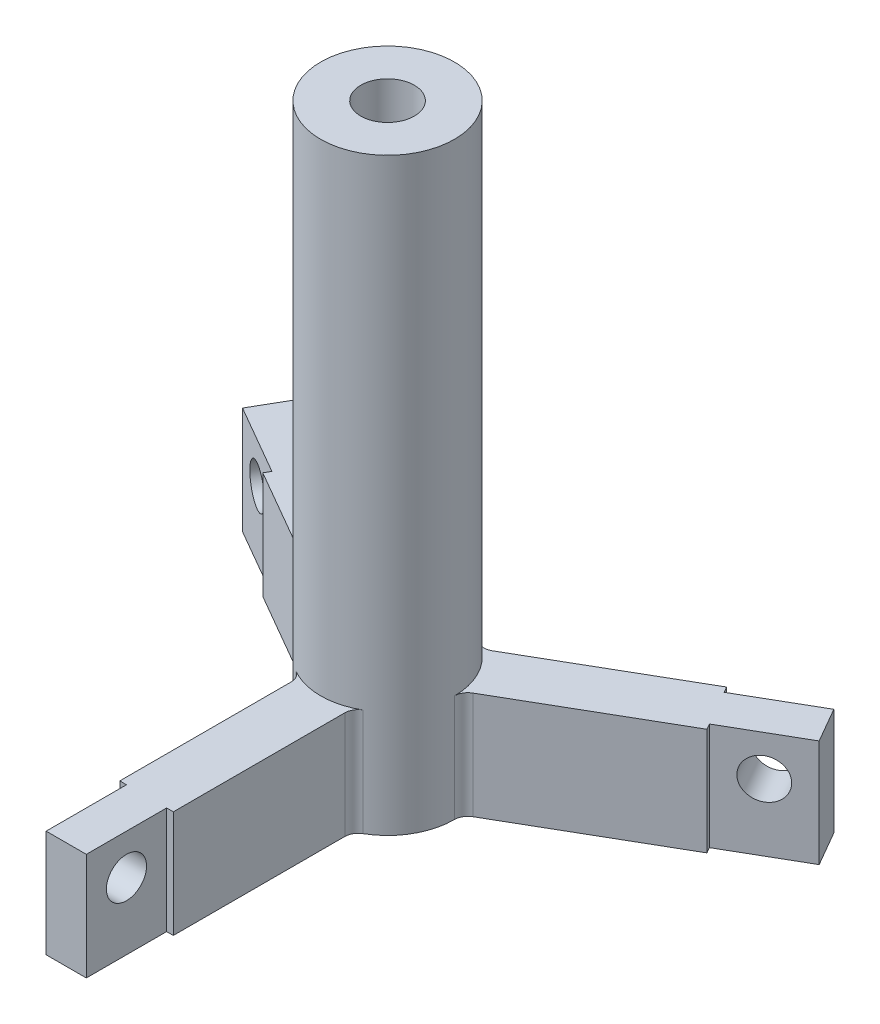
from build123d import *

# Parameters (mm, degrees)
BOSS_EXTRUDE1_REACH      = 170.065
BOSS_EXTRUDE1_END_RADIUS = 15.875
SKETCH2_W                = 9.525
SKETCH2_H                = 25.4
SKETCH3_R                = 4.7625
CUT_EXTRUDE1_DEPTH       = 161.463193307
BOSS_EXTRUDE2_REACH      = 160.432
BOSS_EXTRUDE2_END_RADIUS = 15.875
SKETCH4_W                = 12.7
SKETCH4_H                = 25.4
FILLET1_R                = 3.175
CIRPATTERN1_COUNT        = 3
FILLET1_OF_CIRPATTERN1_R = 3.175
SKETCH5_R                = 7.9375
CUT_EXTRUDE3_DEPTH       = 0.635
SKETCH6_R                = 3.175
CUT_EXTRUDE4_DEPTH       = 12.7


with BuildPart() as part:
    # Sketch1 → Base-Revolve (revolve)
    with BuildSketch(Plane.XY, mode=Mode.PRIVATE) as base_revolve_sk:
        Polygon((12.7, 0), (12.7, 127), (6.35, 127), (6.35, 139.7), (15.875, 139.7), (15.875, 0), align=None)
    revolve(base_revolve_sk.sketch.rotate(Axis((0, 118.223731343, 0), (0, -1, 0)), 90), axis=Axis((0, 118.223731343, 0), (0, -1, 0)))

    # Boss-Extrude1: up to this cylinder (the profile starts outside it)
    boss_extrude1_end = Plane(origin=(0, 12.7, 0), z_dir=(0, 1, 0)) * Cylinder(BOSS_EXTRUDE1_END_RADIUS, 372.88, mode=Mode.PRIVATE)
    # Sketch2 → Boss-Extrude1 (add, up to the surface)
    with BuildSketch(Plane.XY.offset(76.2), mode=Mode.PRIVATE) as boss_extrude1_sk1:
        with Locations((0, 12.7)):
            Rectangle(SKETCH2_W, SKETCH2_H)
    boss_extrude1_tool1 = extrude(boss_extrude1_sk1.sketch, amount=-BOSS_EXTRUDE1_REACH, mode=Mode.PRIVATE) - boss_extrude1_end
    boss_extrude1 = boss_extrude1_tool1.solids().sort_by_distance((0, 12.7, 76.2))[0]
    add(boss_extrude1)

    # Sketch3 → Cut-Extrude1 (cut, through all)
    with BuildSketch(Plane(origin=(4.7625, 0, 0), x_dir=(0, 0, -1), z_dir=(1, 0, 0))):
        with Locations((-66.675, 15.875)):
            Circle(SKETCH3_R)
    cut_extrude1 = extrude(amount=-CUT_EXTRUDE1_DEPTH, mode=Mode.SUBTRACT)

    # Boss-Extrude2: up to this cylinder (the profile starts outside it)
    boss_extrude2_end = Plane(origin=(0, 12.7, 0), z_dir=(0, 1, 0)) * Cylinder(BOSS_EXTRUDE2_END_RADIUS, 353.614, mode=Mode.PRIVATE)
    # Sketch4 → Boss-Extrude2 (add, up to the surface)
    with BuildSketch(Plane.XY.offset(57.15), mode=Mode.PRIVATE) as boss_extrude2_sk1:
        with Locations((0, 12.7)):
            Rectangle(SKETCH4_W, SKETCH4_H)
    boss_extrude2_tool1 = extrude(boss_extrude2_sk1.sketch, amount=-BOSS_EXTRUDE2_REACH, mode=Mode.PRIVATE) - boss_extrude2_end
    boss_extrude2 = boss_extrude2_tool1.solids().sort_by_distance((0, 12.7, 57.15))[0]
    add(boss_extrude2)

    # Fillet1
    fillet1_edges = [part.edges().sort_by_distance(p)[0] for p in [
        (-6.35, 12.7, 14.549677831),
        (6.35, 12.7, 14.549677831),
    ]]
    fillet(fillet1_edges, radius=FILLET1_R)

    # CirPattern1: Boss-Extrude1, Cut-Extrude1, Boss-Extrude2 ×3 about axis
    cirpattern1_axis = Axis((0, 0, 0), (0, 1, 0))
    add([boss_extrude1.rotate(cirpattern1_axis, i * 360 / CIRPATTERN1_COUNT) for i in range(1, CIRPATTERN1_COUNT)])
    add([cut_extrude1.rotate(cirpattern1_axis, i * 360 / CIRPATTERN1_COUNT) for i in range(1, CIRPATTERN1_COUNT)], mode=Mode.SUBTRACT)
    add([boss_extrude2.rotate(cirpattern1_axis, i * 360 / CIRPATTERN1_COUNT) for i in range(1, CIRPATTERN1_COUNT)])

    # Fillet1 of CirPattern1
    fillet1_of_cirpattern1_edges = [part.edges().sort_by_distance(p)[0] for p in [
        (15.775390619, 12.7, -1.775577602),
        (9.425390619, 12.7, -12.77410023),
        (-9.425390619, 12.7, -12.77410023),
        (-15.775390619, 12.7, -1.775577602),
    ]]
    fillet(fillet1_of_cirpattern1_edges, radius=FILLET1_OF_CIRPATTERN1_R)

    # Sketch5 → Cut-Extrude3 (cut)
    with BuildSketch(Plane.XY.offset(-15.875)):
        with Locations((0, 38.1)):
            Circle(SKETCH5_R)
    extrude(amount=CUT_EXTRUDE3_DEPTH, mode=Mode.SUBTRACT)

    # Sketch6 → Cut-Extrude4 (cut)
    with BuildSketch(Plane(origin=(0, 0, -15.24), x_dir=(-1, 0, 0), z_dir=(0, 0, -1))):
        with Locations((0, 38.1)):
            Circle(SKETCH6_R)
    extrude(amount=-CUT_EXTRUDE4_DEPTH, mode=Mode.SUBTRACT)


solid = part.part
